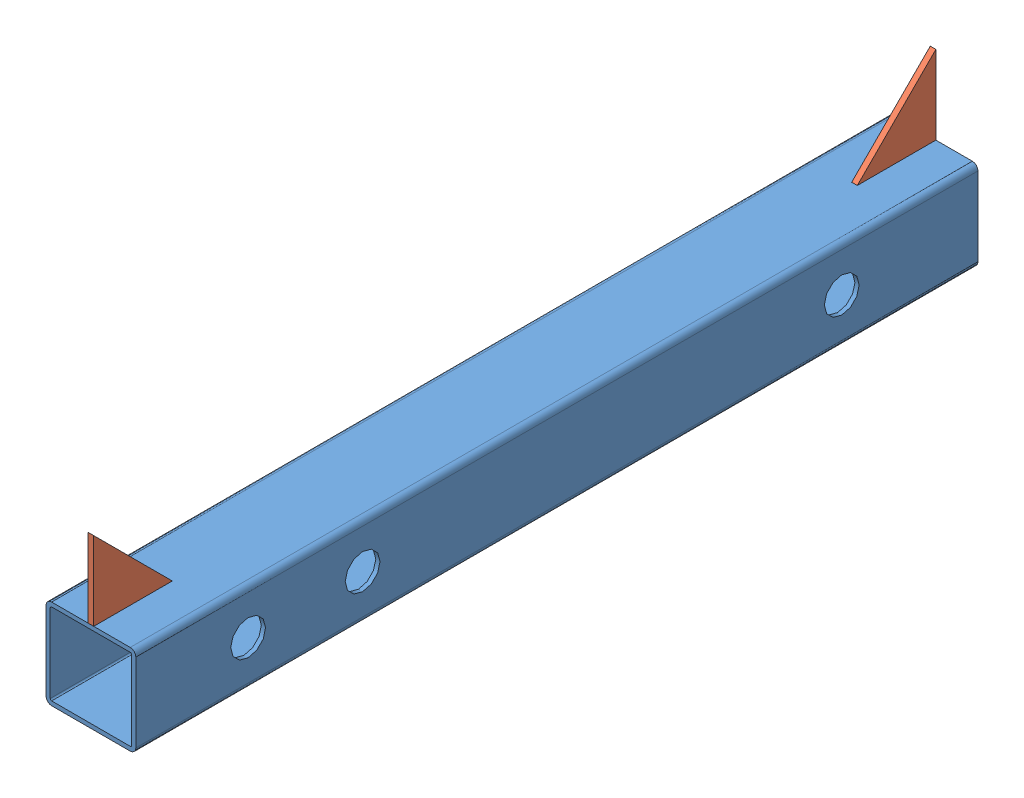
SolidWorks assembly 1080-C1015 REAR CROSS MEMBER.SLDASM, configuration Default (file format 5000). Lengths in mm.
Overall size (101.6 190.5 952.5).
3 component instances, 2 part files, 6 mates.
Components (placement in the parent):
- 1080-C1014 4x4 REAR TUBE CROSS-1: 1080-C1014 4x4 REAR TUBE CROSS.SLDPRT [Default] at origin size (101.6 101.6 952.5)
- 1080-C1013 GUSSET-1: 1080-C1013 GUSSET.SLDPRT [Default] at (-3.175 50.8 -387.35) x (0 0 -1) z (1 0 0) size (88.9 88.9 6.35)
- 1080-C1013 GUSSET-2: 1080-C1013 GUSSET.SLDPRT [Default] at (3.175 50.8 387.35) x (0 0 1) z (-1 0 0) size (88.9 88.9 6.35)
Mates (geometry in assembly coordinates):
- Coincident4: coincident anti-aligned: plane of 1080-C1014 4x4 REAR TUBE CROSS-1 through (-44.45 50.8 476.25) normal (0 1 0); plane of 1080-C1013 GUSSET-2 through (-3.175 50.8 387.35) normal (0 -1 0)
- Coincident6: coincident aligned: plane of 1080-C1014 4x4 REAR TUBE CROSS-1 through (-44.45 44.45 476.25) normal (0 0 1); plane of 1080-C1013 GUSSET-2 through (-3.175 50.8 476.25) normal (0 0 1)
- Coincident10: coincident anti-aligned: plane of 1080-C1014 4x4 REAR TUBE CROSS-1 through (-44.45 50.8 476.25) normal (0 1 0); plane of 1080-C1013 GUSSET-1 through (3.175 50.8 -387.35) normal (0 -1 0)
- Coincident12: coincident aligned: plane of 1080-C1014 4x4 REAR TUBE CROSS-1 through (-44.45 44.45 -476.25) normal (0 0 -1); plane of 1080-C1013 GUSSET-1 through (3.175 50.8 -476.25) normal (0 0 -1)
- Width1: width anti-aligned: plane of 1080-C1014 4x4 REAR TUBE CROSS-1 through (50.8 44.45 476.25) normal (1 0 0); plane of 1080-C1014 4x4 REAR TUBE CROSS-1 through (-50.8 44.45 476.25) normal (-1 0 0); plane of 1080-C1013 GUSSET-1 through (-3.175 50.8 -387.35) normal (-1 0 0); plane of 1080-C1013 GUSSET-1 through (3.175 50.8 -387.35) normal (1 0 0)
- Width2: width anti-aligned: plane of 1080-C1014 4x4 REAR TUBE CROSS-1 through (50.8 44.45 476.25) normal (1 0 0); plane of 1080-C1014 4x4 REAR TUBE CROSS-1 through (-50.8 44.45 476.25) normal (-1 0 0); plane of 1080-C1013 GUSSET-2 through (-3.175 50.8 387.35) normal (-1 0 0); plane of 1080-C1013 GUSSET-2 through (3.175 50.8 387.35) normal (1 0 0)
